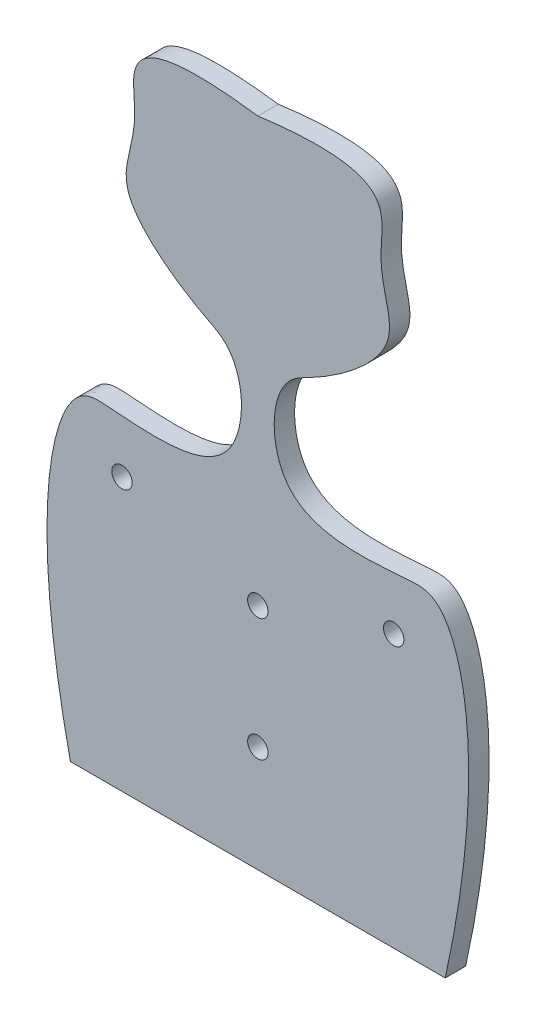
from build123d import *

# Parameters (mm, degrees)
SKETCH1_R           = 1.5875
BOSS_EXTRUDE1_DEPTH = 3.175


with BuildPart() as part:
    # Sketch1 → Boss-Extrude1 (new body)
    with BuildSketch(Plane.XY):
        with BuildLine():
            Line((-29.166634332, 0), (29.166634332, 0))
            add(Edge.make_bspline(
                [(0, 101.6), (18.872778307, 104.132400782), (19.63157741, 98.337983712), (18.635797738, 87.687750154), (23.853192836, 81.879635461), (12.567107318, 72.473127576), (1.896324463, 67.447112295), (1.65675991, 48.483162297), (18.704947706, 50.569751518), (31.523669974, 51.224595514), (35.762820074, 30.008831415), (29.166634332, 0)],
                knots=[0, 0, 0, 0, 0.12563687, 0.160475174, 0.348383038, 0.494672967, 0.524046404, 0.642117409, 0.813384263, 0.849172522, 1, 1, 1, 1], degree=3))
            add(Edge.make_bspline(
                [(0, 101.6), (-18.872778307, 104.132400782), (-19.63157741, 98.337983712), (-18.635797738, 87.687750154), (-23.853192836, 81.879635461), (-12.567107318, 72.473127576), (-1.896324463, 67.447112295), (-1.65675991, 48.483162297), (-18.704947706, 50.569751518), (-31.523669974, 51.224595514), (-35.762820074, 30.008831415), (-29.166634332, 0)],
                knots=[0, 0, 0, 0, 0.12563687, 0.160475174, 0.348383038, 0.494672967, 0.524046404, 0.642117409, 0.813384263, 0.849172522, 1, 1, 1, 1], degree=3))
        make_face()
        with Locations((-21.145658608, 42.370919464)):
            Circle(SKETCH1_R, mode=Mode.SUBTRACT)
        with Locations(Location((21.145658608, 42.370919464, 0), (0, 0, 180))):
            Circle(SKETCH1_R, mode=Mode.SUBTRACT)
        with Locations((0, 35.600944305)):
            Circle(SKETCH1_R, mode=Mode.SUBTRACT)
        with Locations((0, 16.550944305)):
            Circle(SKETCH1_R, mode=Mode.SUBTRACT)
    extrude(amount=BOSS_EXTRUDE1_DEPTH)


solid = part.part
